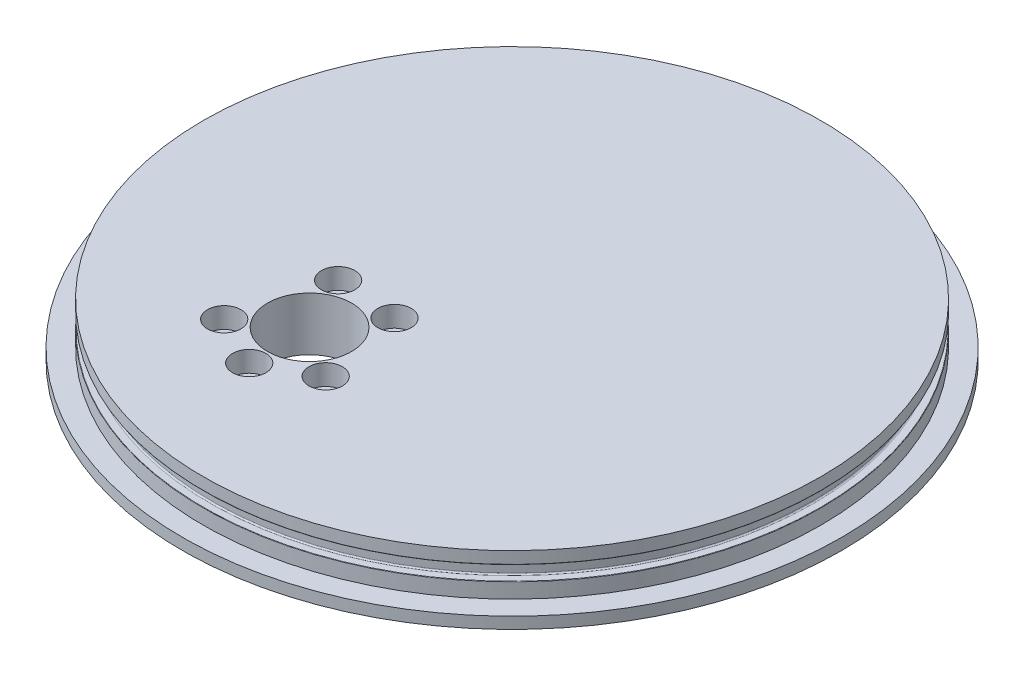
from build123d import *

# Parameters (mm, degrees)
SKETCH7_R                                  = 13.97
CUT_EXTRUDE2_DEPTH                         = 156.926444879
F_17_64_0_26563_DIAMETER_HOLE1_D           = 6.7564
F_17_64_0_26563_DIAMETER_HOLE1_CBORE_D     = 11.1125
F_17_64_0_26563_DIAMETER_HOLE1_CBORE_DEPTH = 6.858


with BuildPart() as part:
    # Sketch1 → Revolve1 (revolve)
    with BuildSketch(Plane.XY, mode=Mode.PRIVATE) as revolve1_sk:
        with BuildLine():
            Line((0, 13.97), (-102.5906, 13.97))
            Line((-102.5906, 13.97), (-102.5906, 10.0203))
            ThreePointArc((-102.5906, 10.0203), (-102.553402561, 9.930497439), (-102.4636, 9.8933))
            Line((-102.4636, 9.8933), (-100.2157, 9.8933))
            ThreePointArc((-100.2157, 9.8933), (-99.901391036, 9.763108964), (-99.7712, 9.4488))
            Line((-99.7712, 9.4488), (-99.7712, 5.5245))
            ThreePointArc((-99.7712, 5.5245), (-99.901391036, 5.210191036), (-100.2157, 5.08))
            Line((-100.2157, 5.08), (-102.4636, 5.08))
            ThreePointArc((-102.4636, 5.08), (-102.553402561, 5.042802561), (-102.5906, 4.953))
            Line((-102.5906, 4.953), (-102.5906, 0))
            Line((-102.5906, 0), (-109.5375, 0))
            Line((-109.5375, 0), (-109.5375, -3.81))
            Line((-109.5375, -3.81), (0, -3.81))
            Line((0, -3.81), (0, 13.97))
        make_face()
    revolve(revolve1_sk.sketch.rotate(Axis((0, 13.97, 0), (0, 1, 0)), 180), axis=Axis((0, 13.97, 0), (0, 1, 0)))

    # Sketch7 → Cut-Extrude2 (cut, through all)
    with BuildSketch(Plane(origin=(0, 13.97, 0), x_dir=(1, 0, 0), z_dir=(0, 1, 0))):
        with Locations(Location((-25.4, -41.91, 0), (0, 0, 180))):
            Circle(SKETCH7_R)
    extrude(amount=-CUT_EXTRUDE2_DEPTH, mode=Mode.SUBTRACT)

    # 17_64 _0.26563_ Diameter Hole1 (through all)
    with Locations(Plane(origin=(0, 13.97, 0), x_dir=(1, 0, 0), z_dir=(0, 1, 0))):
        with Locations((-34.210136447, -23.599240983), (-13.947485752, -25.124818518), (-41.889237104, -53.784656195), (-25.130688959, -62.228215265), (-8.601821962, -53.343442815)):
            CounterBoreHole(F_17_64_0_26563_DIAMETER_HOLE1_D / 2, F_17_64_0_26563_DIAMETER_HOLE1_CBORE_D / 2, F_17_64_0_26563_DIAMETER_HOLE1_CBORE_DEPTH)


solid = part.part
